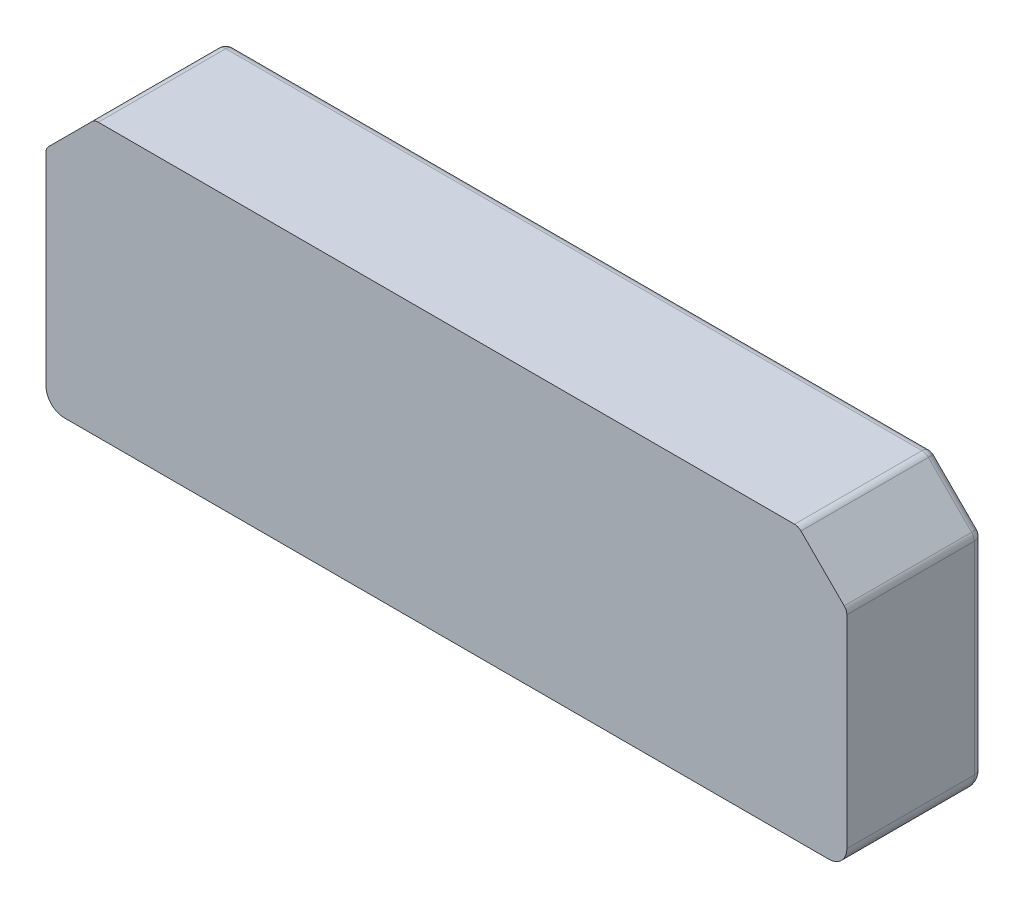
from build123d import *

# Parameters (mm, degrees)
EXTRUDE_1_DEPTH = 45
FILLET_1_R      = 3


with BuildPart() as part:
    # Sketch 1 → Extrude 1 (new body)
    with BuildSketch(Plane.XY):
        with BuildLine():
            Line((-126, 0), (126, 0))
            ThreePointArc((126, 0), (130.242640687, 1.757359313), (132, 6.000000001))
            Line((132, 6.000000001), (132, 72.757359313))
            ThreePointArc((132, 72.757359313), (131.771638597, 73.90540961), (131.121320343, 74.878679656))
            Line((131.121320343, 74.878679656), (116.878679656, 89.121320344))
            ThreePointArc((116.878679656, 89.121320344), (115.90540961, 89.771638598), (114.757359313, 90))
            Line((114.757359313, 90), (-114.757359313, 90))
            ThreePointArc((-114.757359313, 90), (-115.90540961, 89.771638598), (-116.878679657, 89.121320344))
            Line((-116.878679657, 89.121320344), (-131.121320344, 74.878679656))
            ThreePointArc((-131.121320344, 74.878679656), (-131.771638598, 73.90540961), (-132, 72.757359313))
            Line((-132, 72.757359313), (-132, 6))
            ThreePointArc((-132, 6), (-130.242640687, 1.757359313), (-126, 0))
        make_face()
    extrude(amount=EXTRUDE_1_DEPTH)

    # Fillet 1
    fillet_1_edges = [part.edges().sort_by_distance(p)[0] for p in [
        (-132, 39.378679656, 0),
        (-131.771638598, 73.90540961, 0),
        (-124, 82, 0),
        (-115.90540961, 89.771638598, 0),
        (0, 90, 0),
        (115.90540961, 89.771638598, 0),
        (124, 82, 0),
        (131.771638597, 73.90540961, 0),
        (132, 39.378679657, 0),
        (130.242640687, 1.757359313, 0),
        (0, 0, 0),
        (-130.242640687, 1.757359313, 0),
    ]]
    fillet(fillet_1_edges, radius=FILLET_1_R)


solid = part.part
